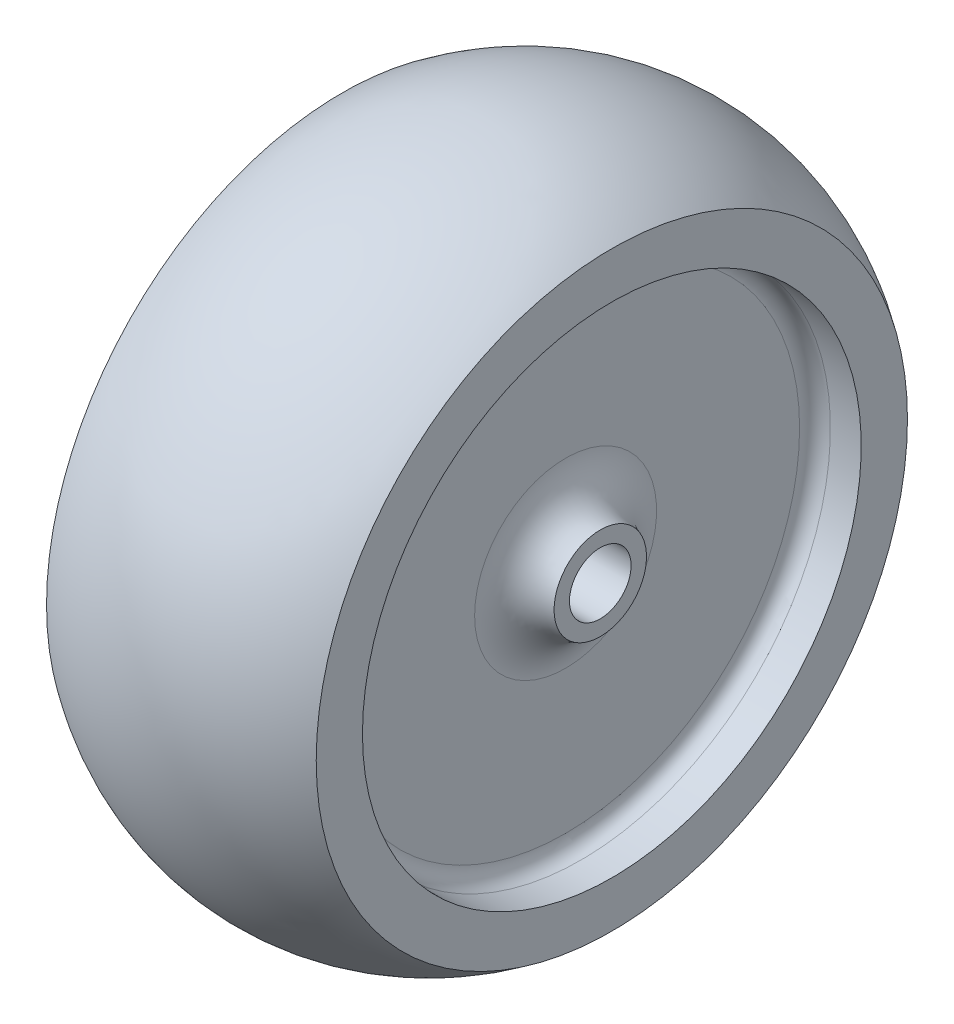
ISO-10303-21;
HEADER;
FILE_DESCRIPTION(('STEP AP214'),'2;1');
FILE_NAME('part.step','',(''),(''),'','','');
FILE_SCHEMA(('AUTOMOTIVE_DESIGN { 1 0 10303 214 1 1 1 1 }'));
ENDSEC;
DATA;
#1=APPLICATION_CONTEXT('core data for automotive mechanical design processes');
#2=APPLICATION_PROTOCOL_DEFINITION('international standard','automotive_design',2000,#1);
#3=PRODUCT_CONTEXT('',#1,'mechanical');
#4=PRODUCT('Part','Part','',(#3));
#5=PRODUCT_RELATED_PRODUCT_CATEGORY('part','',(#4));
#6=PRODUCT_DEFINITION_FORMATION('','',#4);
#7=PRODUCT_DEFINITION_CONTEXT('part definition',#1,'design');
#8=PRODUCT_DEFINITION('design','',#6,#7);
#9=PRODUCT_DEFINITION_SHAPE('','',#8);
#10=(LENGTH_UNIT() NAMED_UNIT(*) SI_UNIT(.MILLI.,.METRE.));
#11=(NAMED_UNIT(*) PLANE_ANGLE_UNIT() SI_UNIT($,.RADIAN.));
#12=(NAMED_UNIT(*) SI_UNIT($,.STERADIAN.) SOLID_ANGLE_UNIT());
#13=UNCERTAINTY_MEASURE_WITH_UNIT(LENGTH_MEASURE(1.E-05),#10,'distance_accuracy_value','');
#14=(GEOMETRIC_REPRESENTATION_CONTEXT(3) GLOBAL_UNCERTAINTY_ASSIGNED_CONTEXT((#13)) GLOBAL_UNIT_ASSIGNED_CONTEXT((#10,
#11,#12)) REPRESENTATION_CONTEXT('',''));
#15=CARTESIAN_POINT('',(0.,0.,0.));
#16=DIRECTION('',(0.,0.,1.));
#17=DIRECTION('',(1.,0.,0.));
#18=AXIS2_PLACEMENT_3D('',#15,#16,#17);
#19=CARTESIAN_POINT('',(13.5000000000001,0.,0.));
#20=DIRECTION('',(-1.,0.,0.));
#21=DIRECTION('',(0.,0.,1.));
#22=AXIS2_PLACEMENT_3D('',#19,#20,#21);
#23=DEGENERATE_TOROIDAL_SURFACE('',#22,14.,30.,.T.);
#24=CARTESIAN_POINT('',(-3.99999999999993,0.,0.));
#25=DIRECTION('',(-1.,0.,0.));
#26=DIRECTION('',(0.,0.,1.));
#27=AXIS2_PLACEMENT_3D('',#24,#25,#26);
#28=CIRCLE('',#27,38.3669858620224);
#29=CARTESIAN_POINT('',(-3.99999999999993,0.,38.3669858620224));
#30=VERTEX_POINT('',#29);
#31=EDGE_CURVE('E93',#30,#30,#28,.T.);
#32=ORIENTED_EDGE('',*,*,#31,.F.);
#33=EDGE_LOOP('',(#32));
#34=FACE_BOUND('',#33,.T.);
#35=CARTESIAN_POINT('',(31.0000000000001,0.,0.));
#36=DIRECTION('',(-1.,0.,0.));
#37=DIRECTION('',(0.,0.,1.));
#38=AXIS2_PLACEMENT_3D('',#35,#36,#37);
#39=CIRCLE('',#38,38.3669858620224);
#40=CARTESIAN_POINT('',(31.0000000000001,0.,38.3669858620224));
#41=VERTEX_POINT('',#40);
#42=EDGE_CURVE('E57',#41,#41,#39,.T.);
#43=ORIENTED_EDGE('',*,*,#42,.T.);
#44=EDGE_LOOP('',(#43));
#45=FACE_BOUND('',#44,.T.);
#46=ADVANCED_FACE('F46',(#34,#45),#23,.T.);
#47=CARTESIAN_POINT('',(31.0000000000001,38.3669858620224,0.));
#48=DIRECTION('',(-1.,0.,0.));
#49=DIRECTION('',(0.,0.,1.));
#50=AXIS2_PLACEMENT_3D('',#47,#48,#49);
#51=PLANE('',#50);
#52=ORIENTED_EDGE('',*,*,#42,.F.);
#53=EDGE_LOOP('',(#52));
#54=FACE_BOUND('',#53,.T.);
#55=CARTESIAN_POINT('',(31.0000000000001,0.,0.));
#56=DIRECTION('',(-1.,0.,0.));
#57=DIRECTION('',(0.,0.,1.));
#58=AXIS2_PLACEMENT_3D('',#55,#56,#57);
#59=CIRCLE('',#58,32.3669858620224);
#60=CARTESIAN_POINT('',(31.0000000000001,0.,32.3669858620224));
#61=VERTEX_POINT('',#60);
#62=EDGE_CURVE('E61',#61,#61,#59,.T.);
#63=ORIENTED_EDGE('',*,*,#62,.T.);
#64=EDGE_LOOP('',(#63));
#65=FACE_BOUND('',#64,.T.);
#66=ADVANCED_FACE('F101',(#54,#65),#51,.F.);
#67=CARTESIAN_POINT('',(0.,0.,0.));
#68=DIRECTION('',(-1.,0.,0.));
#69=DIRECTION('',(0.,0.,1.));
#70=AXIS2_PLACEMENT_3D('',#67,#68,#69);
#71=CYLINDRICAL_SURFACE('',#70,32.3669858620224);
#72=ORIENTED_EDGE('',*,*,#62,.F.);
#73=EDGE_LOOP('',(#72));
#74=FACE_BOUND('',#73,.T.);
#75=CARTESIAN_POINT('',(27.0000000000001,0.,0.));
#76=DIRECTION('',(-1.,0.,0.));
#77=DIRECTION('',(0.,0.,1.));
#78=AXIS2_PLACEMENT_3D('',#75,#76,#77);
#79=CIRCLE('',#78,32.3669858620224);
#80=CARTESIAN_POINT('',(27.0000000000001,0.,32.3669858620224));
#81=VERTEX_POINT('',#80);
#82=EDGE_CURVE('E66',#81,#81,#79,.T.);
#83=ORIENTED_EDGE('',*,*,#82,.T.);
#84=EDGE_LOOP('',(#83));
#85=FACE_BOUND('',#84,.T.);
#86=ADVANCED_FACE('F107',(#74,#85),#71,.F.);
#87=CARTESIAN_POINT('',(27.0000000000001,0.,0.));
#88=DIRECTION('',(-1.,0.,0.));
#89=DIRECTION('',(0.,0.,1.));
#90=AXIS2_PLACEMENT_3D('',#87,#88,#89);
#91=TOROIDAL_SURFACE('',#90,30.3669858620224,2.);
#92=ORIENTED_EDGE('',*,*,#82,.F.);
#93=EDGE_LOOP('',(#92));
#94=FACE_BOUND('',#93,.T.);
#95=CARTESIAN_POINT('',(25.0000000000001,0.,0.));
#96=DIRECTION('',(-1.,0.,0.));
#97=DIRECTION('',(0.,0.,1.));
#98=AXIS2_PLACEMENT_3D('',#95,#96,#97);
#99=CIRCLE('',#98,30.3669858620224);
#100=CARTESIAN_POINT('',(25.0000000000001,0.,30.3669858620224));
#101=VERTEX_POINT('',#100);
#102=EDGE_CURVE('E69',#101,#101,#99,.T.);
#103=ORIENTED_EDGE('',*,*,#102,.T.);
#104=EDGE_LOOP('',(#103));
#105=FACE_BOUND('',#104,.T.);
#106=ADVANCED_FACE('F113',(#94,#105),#91,.F.);
#107=CARTESIAN_POINT('',(25.0000000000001,6.,0.));
#108=DIRECTION('',(-1.,0.,0.));
#109=DIRECTION('',(0.,0.,1.));
#110=AXIS2_PLACEMENT_3D('',#107,#108,#109);
#111=PLANE('',#110);
#112=CARTESIAN_POINT('',(25.0000000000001,0.,0.));
#113=DIRECTION('',(-1.,0.,0.));
#114=DIRECTION('',(0.,0.,1.));
#115=AXIS2_PLACEMENT_3D('',#112,#113,#114);
#116=CIRCLE('',#115,11.8094750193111);
#117=CARTESIAN_POINT('',(25.0000000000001,0.,11.8094750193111));
#118=VERTEX_POINT('',#117);
#119=EDGE_CURVE('E53',#118,#118,#116,.T.);
#120=ORIENTED_EDGE('',*,*,#119,.T.);
#121=EDGE_LOOP('',(#120));
#122=FACE_BOUND('',#121,.T.);
#123=ORIENTED_EDGE('',*,*,#102,.F.);
#124=EDGE_LOOP('',(#123));
#125=FACE_BOUND('',#124,.T.);
#126=ADVANCED_FACE('F119',(#122,#125),#111,.F.);
#127=CARTESIAN_POINT('',(29.5000000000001,6.,0.));
#128=DIRECTION('',(-1.,0.,0.));
#129=DIRECTION('',(0.,0.,1.));
#130=AXIS2_PLACEMENT_3D('',#127,#128,#129);
#131=PLANE('',#130);
#132=CARTESIAN_POINT('',(29.5000000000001,0.,0.));
#133=DIRECTION('',(-1.,0.,0.));
#134=DIRECTION('',(0.,0.,1.));
#135=AXIS2_PLACEMENT_3D('',#132,#133,#134);
#136=CIRCLE('',#135,6.);
#137=CARTESIAN_POINT('',(29.5000000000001,0.,6.));
#138=VERTEX_POINT('',#137);
#139=EDGE_CURVE('E72',#138,#138,#136,.T.);
#140=ORIENTED_EDGE('',*,*,#139,.F.);
#141=EDGE_LOOP('',(#140));
#142=FACE_BOUND('',#141,.T.);
#143=CARTESIAN_POINT('',(29.5000000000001,0.,0.));
#144=DIRECTION('',(-1.,0.,0.));
#145=DIRECTION('',(0.,0.,1.));
#146=AXIS2_PLACEMENT_3D('',#143,#144,#145);
#147=CIRCLE('',#146,4.);
#148=CARTESIAN_POINT('',(29.5000000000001,0.,4.));
#149=VERTEX_POINT('',#148);
#150=EDGE_CURVE('E75',#149,#149,#147,.T.);
#151=ORIENTED_EDGE('',*,*,#150,.T.);
#152=EDGE_LOOP('',(#151));
#153=FACE_BOUND('',#152,.T.);
#154=ADVANCED_FACE('F124',(#142,#153),#131,.F.);
#155=CARTESIAN_POINT('',(0.,0.,0.));
#156=DIRECTION('',(-1.,0.,0.));
#157=DIRECTION('',(0.,0.,1.));
#158=AXIS2_PLACEMENT_3D('',#155,#156,#157);
#159=CYLINDRICAL_SURFACE('',#158,4.);
#160=ORIENTED_EDGE('',*,*,#150,.F.);
#161=EDGE_LOOP('',(#160));
#162=FACE_BOUND('',#161,.T.);
#163=CARTESIAN_POINT('',(-2.49999999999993,0.,0.));
#164=DIRECTION('',(-1.,0.,0.));
#165=DIRECTION('',(0.,0.,1.));
#166=AXIS2_PLACEMENT_3D('',#163,#164,#165);
#167=CIRCLE('',#166,4.);
#168=CARTESIAN_POINT('',(-2.49999999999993,0.,4.));
#169=VERTEX_POINT('',#168);
#170=EDGE_CURVE('E78',#169,#169,#167,.T.);
#171=ORIENTED_EDGE('',*,*,#170,.T.);
#172=EDGE_LOOP('',(#171));
#173=FACE_BOUND('',#172,.T.);
#174=ADVANCED_FACE('F129',(#162,#173),#159,.F.);
#175=CARTESIAN_POINT('',(-2.49999999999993,4.,0.));
#176=DIRECTION('',(1.,0.,0.));
#177=DIRECTION('',(0.,0.,-1.));
#178=AXIS2_PLACEMENT_3D('',#175,#176,#177);
#179=PLANE('',#178);
#180=ORIENTED_EDGE('',*,*,#170,.F.);
#181=EDGE_LOOP('',(#180));
#182=FACE_BOUND('',#181,.T.);
#183=CARTESIAN_POINT('',(-2.49999999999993,0.,0.));
#184=DIRECTION('',(-1.,0.,0.));
#185=DIRECTION('',(0.,0.,1.));
#186=AXIS2_PLACEMENT_3D('',#183,#184,#185);
#187=CIRCLE('',#186,6.);
#188=CARTESIAN_POINT('',(-2.49999999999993,0.,6.));
#189=VERTEX_POINT('',#188);
#190=EDGE_CURVE('E81',#189,#189,#187,.T.);
#191=ORIENTED_EDGE('',*,*,#190,.T.);
#192=EDGE_LOOP('',(#191));
#193=FACE_BOUND('',#192,.T.);
#194=ADVANCED_FACE('F151',(#182,#193),#179,.F.);
#195=CARTESIAN_POINT('',(2.00000000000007,6.,0.));
#196=DIRECTION('',(1.,0.,0.));
#197=DIRECTION('',(0.,0.,-1.));
#198=AXIS2_PLACEMENT_3D('',#195,#196,#197);
#199=PLANE('',#198);
#200=CARTESIAN_POINT('',(2.00000000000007,0.,0.));
#201=DIRECTION('',(1.,0.,0.));
#202=DIRECTION('',(0.,0.,-1.));
#203=AXIS2_PLACEMENT_3D('',#200,#201,#202);
#204=CIRCLE('',#203,11.8094750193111);
#205=CARTESIAN_POINT('',(2.00000000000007,0.,-11.8094750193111));
#206=VERTEX_POINT('',#205);
#207=EDGE_CURVE('E12',#206,#206,#204,.T.);
#208=ORIENTED_EDGE('',*,*,#207,.T.);
#209=EDGE_LOOP('',(#208));
#210=FACE_BOUND('',#209,.T.);
#211=CARTESIAN_POINT('',(2.00000000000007,0.,0.));
#212=DIRECTION('',(-1.,0.,0.));
#213=DIRECTION('',(0.,0.,1.));
#214=AXIS2_PLACEMENT_3D('',#211,#212,#213);
#215=CIRCLE('',#214,30.3669858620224);
#216=CARTESIAN_POINT('',(2.00000000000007,0.,30.3669858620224));
#217=VERTEX_POINT('',#216);
#218=EDGE_CURVE('E84',#217,#217,#215,.T.);
#219=ORIENTED_EDGE('',*,*,#218,.T.);
#220=EDGE_LOOP('',(#219));
#221=FACE_BOUND('',#220,.T.);
#222=ADVANCED_FACE('F156',(#210,#221),#199,.F.);
#223=CARTESIAN_POINT('',(0.,0.,0.));
#224=DIRECTION('',(-1.,0.,0.));
#225=DIRECTION('',(0.,0.,1.));
#226=AXIS2_PLACEMENT_3D('',#223,#224,#225);
#227=TOROIDAL_SURFACE('',#226,30.3669858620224,2.);
#228=ORIENTED_EDGE('',*,*,#218,.F.);
#229=EDGE_LOOP('',(#228));
#230=FACE_BOUND('',#229,.T.);
#231=CARTESIAN_POINT('',(0.,0.,0.));
#232=DIRECTION('',(-1.,0.,0.));
#233=DIRECTION('',(0.,0.,1.));
#234=AXIS2_PLACEMENT_3D('',#231,#232,#233);
#235=CIRCLE('',#234,32.3669858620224);
#236=CARTESIAN_POINT('',(0.,0.,32.3669858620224));
#237=VERTEX_POINT('',#236);
#238=EDGE_CURVE('E87',#237,#237,#235,.T.);
#239=ORIENTED_EDGE('',*,*,#238,.T.);
#240=EDGE_LOOP('',(#239));
#241=FACE_BOUND('',#240,.T.);
#242=ADVANCED_FACE('F163',(#230,#241),#227,.F.);
#243=CARTESIAN_POINT('',(0.,0.,0.));
#244=DIRECTION('',(-1.,0.,0.));
#245=DIRECTION('',(0.,0.,1.));
#246=AXIS2_PLACEMENT_3D('',#243,#244,#245);
#247=CYLINDRICAL_SURFACE('',#246,32.3669858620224);
#248=ORIENTED_EDGE('',*,*,#238,.F.);
#249=EDGE_LOOP('',(#248));
#250=FACE_BOUND('',#249,.T.);
#251=CARTESIAN_POINT('',(-3.99999999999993,0.,0.));
#252=DIRECTION('',(-1.,0.,0.));
#253=DIRECTION('',(0.,0.,1.));
#254=AXIS2_PLACEMENT_3D('',#251,#252,#253);
#255=CIRCLE('',#254,32.3669858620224);
#256=CARTESIAN_POINT('',(-3.99999999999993,0.,32.3669858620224));
#257=VERTEX_POINT('',#256);
#258=EDGE_CURVE('E90',#257,#257,#255,.T.);
#259=ORIENTED_EDGE('',*,*,#258,.T.);
#260=EDGE_LOOP('',(#259));
#261=FACE_BOUND('',#260,.T.);
#262=ADVANCED_FACE('F141',(#250,#261),#247,.F.);
#263=CARTESIAN_POINT('',(-3.99999999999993,32.3669858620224,0.));
#264=DIRECTION('',(1.,0.,0.));
#265=DIRECTION('',(0.,0.,-1.));
#266=AXIS2_PLACEMENT_3D('',#263,#264,#265);
#267=PLANE('',#266);
#268=ORIENTED_EDGE('',*,*,#258,.F.);
#269=EDGE_LOOP('',(#268));
#270=FACE_BOUND('',#269,.T.);
#271=ORIENTED_EDGE('',*,*,#31,.T.);
#272=EDGE_LOOP('',(#271));
#273=FACE_BOUND('',#272,.T.);
#274=ADVANCED_FACE('F97',(#270,#273),#267,.F.);
#275=CARTESIAN_POINT('',(31.0000000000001,0.,0.));
#276=DIRECTION('',(-1.,0.,0.));
#277=DIRECTION('',(0.,0.,1.));
#278=AXIS2_PLACEMENT_3D('',#275,#276,#277);
#279=TOROIDAL_SURFACE('',#278,11.8094750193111,6.);
#280=ORIENTED_EDGE('',*,*,#139,.T.);
#281=EDGE_LOOP('',(#280));
#282=FACE_BOUND('',#281,.T.);
#283=ORIENTED_EDGE('',*,*,#119,.F.);
#284=EDGE_LOOP('',(#283));
#285=FACE_BOUND('',#284,.T.);
#286=ADVANCED_FACE('F133',(#282,#285),#279,.F.);
#287=CARTESIAN_POINT('',(-3.99999999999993,0.,0.));
#288=DIRECTION('',(1.,0.,0.));
#289=DIRECTION('',(0.,0.,-1.));
#290=AXIS2_PLACEMENT_3D('',#287,#288,#289);
#291=TOROIDAL_SURFACE('',#290,11.8094750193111,6.);
#292=ORIENTED_EDGE('',*,*,#207,.F.);
#293=EDGE_LOOP('',(#292));
#294=FACE_BOUND('',#293,.T.);
#295=ORIENTED_EDGE('',*,*,#190,.F.);
#296=EDGE_LOOP('',(#295));
#297=FACE_BOUND('',#296,.T.);
#298=ADVANCED_FACE('F48',(#294,#297),#291,.F.);
#299=CLOSED_SHELL('',(#46,#66,#86,#106,#126,#154,#174,#194,#222,#242,#262,#274,#286,#298));
#300=MANIFOLD_SOLID_BREP('B2',#299);
#301=ADVANCED_BREP_SHAPE_REPRESENTATION('',(#18,#300),#14);
#302=SHAPE_DEFINITION_REPRESENTATION(#9,#301);
ENDSEC;
END-ISO-10303-21;
